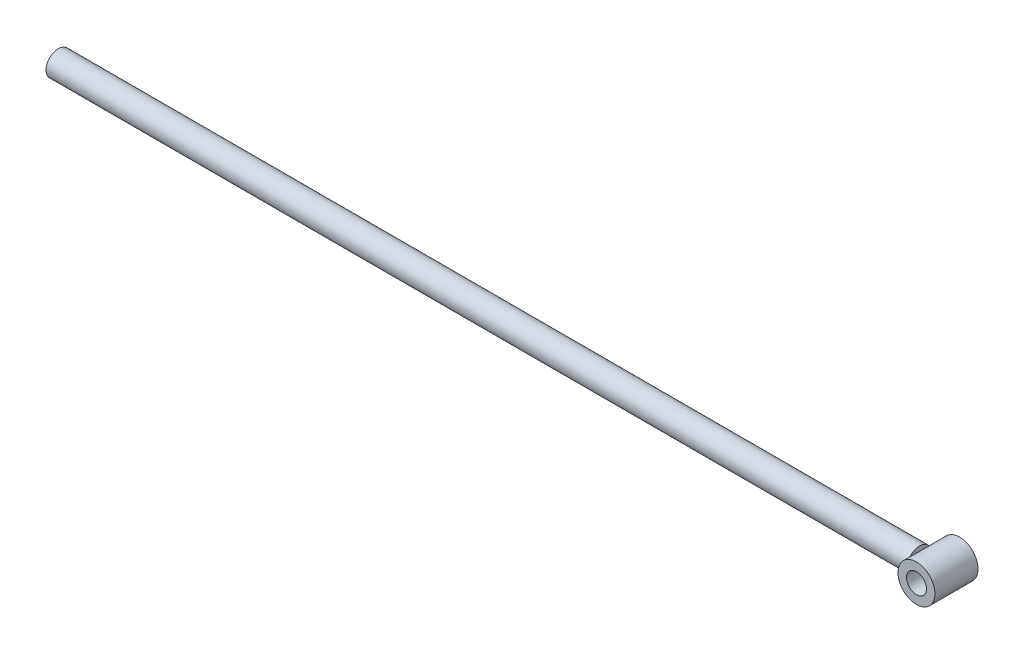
ISO-10303-21;
HEADER;
FILE_DESCRIPTION(('STEP AP214'),'2;1');
FILE_NAME('part.step','',(''),(''),'','','');
FILE_SCHEMA(('AUTOMOTIVE_DESIGN { 1 0 10303 214 1 1 1 1 }'));
ENDSEC;
DATA;
#1=APPLICATION_CONTEXT('core data for automotive mechanical design processes');
#2=APPLICATION_PROTOCOL_DEFINITION('international standard','automotive_design',2000,#1);
#3=PRODUCT_CONTEXT('',#1,'mechanical');
#4=PRODUCT('Part','Part','',(#3));
#5=PRODUCT_RELATED_PRODUCT_CATEGORY('part','',(#4));
#6=PRODUCT_DEFINITION_FORMATION('','',#4);
#7=PRODUCT_DEFINITION_CONTEXT('part definition',#1,'design');
#8=PRODUCT_DEFINITION('design','',#6,#7);
#9=PRODUCT_DEFINITION_SHAPE('','',#8);
#10=(LENGTH_UNIT() NAMED_UNIT(*) SI_UNIT(.MILLI.,.METRE.));
#11=(NAMED_UNIT(*) PLANE_ANGLE_UNIT() SI_UNIT($,.RADIAN.));
#12=(NAMED_UNIT(*) SI_UNIT($,.STERADIAN.) SOLID_ANGLE_UNIT());
#13=UNCERTAINTY_MEASURE_WITH_UNIT(LENGTH_MEASURE(1.E-05),#10,'distance_accuracy_value','');
#14=(GEOMETRIC_REPRESENTATION_CONTEXT(3) GLOBAL_UNCERTAINTY_ASSIGNED_CONTEXT((#13)) GLOBAL_UNIT_ASSIGNED_CONTEXT((#10,
#11,#12)) REPRESENTATION_CONTEXT('',''));
#15=CARTESIAN_POINT('',(0.,0.,0.));
#16=DIRECTION('',(0.,0.,1.));
#17=DIRECTION('',(1.,0.,0.));
#18=AXIS2_PLACEMENT_3D('',#15,#16,#17);
#19=CARTESIAN_POINT('',(715.,0.,17.5));
#20=DIRECTION('',(0.,0.,1.));
#21=DIRECTION('',(1.,0.,0.));
#22=AXIS2_PLACEMENT_3D('',#19,#20,#21);
#23=PLANE('',#22);
#24=CARTESIAN_POINT('',(715.,0.,17.5));
#25=DIRECTION('',(0.,0.,1.));
#26=DIRECTION('',(1.,0.,0.));
#27=AXIS2_PLACEMENT_3D('',#24,#25,#26);
#28=CIRCLE('',#27,15.);
#29=CARTESIAN_POINT('',(730.,0.,17.5));
#30=VERTEX_POINT('',#29);
#31=EDGE_CURVE('E11',#30,#30,#28,.T.);
#32=ORIENTED_EDGE('',*,*,#31,.T.);
#33=EDGE_LOOP('',(#32));
#34=FACE_BOUND('',#33,.T.);
#35=CARTESIAN_POINT('',(715.,0.,17.5));
#36=DIRECTION('',(0.,0.,1.));
#37=DIRECTION('',(1.,0.,0.));
#38=AXIS2_PLACEMENT_3D('',#35,#36,#37);
#39=CIRCLE('',#38,8.10000000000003);
#40=CARTESIAN_POINT('',(723.1,0.,17.5));
#41=VERTEX_POINT('',#40);
#42=EDGE_CURVE('E48',#41,#41,#39,.T.);
#43=ORIENTED_EDGE('',*,*,#42,.F.);
#44=EDGE_LOOP('',(#43));
#45=FACE_BOUND('',#44,.T.);
#46=ADVANCED_FACE('F37',(#34,#45),#23,.T.);
#47=CARTESIAN_POINT('',(715.,0.,-17.5));
#48=DIRECTION('',(0.,0.,1.));
#49=DIRECTION('',(1.,0.,0.));
#50=AXIS2_PLACEMENT_3D('',#47,#48,#49);
#51=PLANE('',#50);
#52=CARTESIAN_POINT('',(715.,0.,-17.5));
#53=DIRECTION('',(0.,0.,1.));
#54=DIRECTION('',(1.,0.,0.));
#55=AXIS2_PLACEMENT_3D('',#52,#53,#54);
#56=CIRCLE('',#55,15.);
#57=CARTESIAN_POINT('',(730.,0.,-17.5));
#58=VERTEX_POINT('',#57);
#59=EDGE_CURVE('E41',#58,#58,#56,.T.);
#60=ORIENTED_EDGE('',*,*,#59,.F.);
#61=EDGE_LOOP('',(#60));
#62=FACE_BOUND('',#61,.T.);
#63=CARTESIAN_POINT('',(715.,0.,-17.5));
#64=DIRECTION('',(0.,0.,1.));
#65=DIRECTION('',(1.,0.,0.));
#66=AXIS2_PLACEMENT_3D('',#63,#64,#65);
#67=CIRCLE('',#66,8.10000000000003);
#68=CARTESIAN_POINT('',(723.1,0.,-17.5));
#69=VERTEX_POINT('',#68);
#70=EDGE_CURVE('E50',#69,#69,#67,.T.);
#71=ORIENTED_EDGE('',*,*,#70,.T.);
#72=EDGE_LOOP('',(#71));
#73=FACE_BOUND('',#72,.T.);
#74=ADVANCED_FACE('F60',(#62,#73),#51,.F.);
#75=CARTESIAN_POINT('',(715.,0.,17.5));
#76=DIRECTION('',(0.,0.,-1.));
#77=DIRECTION('',(-1.,0.,0.));
#78=AXIS2_PLACEMENT_3D('',#75,#76,#77);
#79=CYLINDRICAL_SURFACE('',#78,15.);
#80=ORIENTED_EDGE('',*,*,#31,.F.);
#81=EDGE_LOOP('',(#80));
#82=FACE_BOUND('',#81,.T.);
#83=ORIENTED_EDGE('',*,*,#59,.T.);
#84=EDGE_LOOP('',(#83));
#85=FACE_BOUND('',#84,.T.);
#86=ADVANCED_FACE('F39',(#82,#85),#79,.T.);
#87=CARTESIAN_POINT('',(715.,0.,17.5));
#88=DIRECTION('',(0.,0.,-1.));
#89=DIRECTION('',(-1.,0.,0.));
#90=AXIS2_PLACEMENT_3D('',#87,#88,#89);
#91=CYLINDRICAL_SURFACE('',#90,8.10000000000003);
#92=ORIENTED_EDGE('',*,*,#42,.T.);
#93=EDGE_LOOP('',(#92));
#94=FACE_BOUND('',#93,.T.);
#95=ORIENTED_EDGE('',*,*,#70,.F.);
#96=EDGE_LOOP('',(#95));
#97=FACE_BOUND('',#96,.T.);
#98=ADVANCED_FACE('F56',(#94,#97),#91,.F.);
#99=CLOSED_SHELL('',(#46,#74,#86,#98));
#100=MANIFOLD_SOLID_BREP('B2',#99);
#101=CARTESIAN_POINT('',(700.,0.,0.));
#102=DIRECTION('',(-1.,0.,0.));
#103=DIRECTION('',(0.,0.,1.));
#104=AXIS2_PLACEMENT_3D('',#101,#102,#103);
#105=CYLINDRICAL_SURFACE('',#104,10.);
#106=CARTESIAN_POINT('',(700.,0.,0.));
#107=DIRECTION('',(1.,0.,0.));
#108=DIRECTION('',(0.,0.,-1.));
#109=AXIS2_PLACEMENT_3D('',#106,#107,#108);
#110=CIRCLE('',#109,10.);
#111=CARTESIAN_POINT('',(700.,0.,-10.));
#112=VERTEX_POINT('',#111);
#113=EDGE_CURVE('E36',#112,#112,#110,.T.);
#114=ORIENTED_EDGE('',*,*,#113,.F.);
#115=EDGE_LOOP('',(#114));
#116=FACE_BOUND('',#115,.T.);
#117=CARTESIAN_POINT('',(0.,0.,0.));
#118=DIRECTION('',(1.,0.,0.));
#119=DIRECTION('',(0.,0.,-1.));
#120=AXIS2_PLACEMENT_3D('',#117,#118,#119);
#121=CIRCLE('',#120,10.);
#122=CARTESIAN_POINT('',(0.,0.,-10.));
#123=VERTEX_POINT('',#122);
#124=EDGE_CURVE('E102',#123,#123,#121,.T.);
#125=ORIENTED_EDGE('',*,*,#124,.T.);
#126=EDGE_LOOP('',(#125));
#127=FACE_BOUND('',#126,.T.);
#128=ADVANCED_FACE('F99',(#116,#127),#105,.T.);
#129=CARTESIAN_POINT('',(700.,0.,0.));
#130=DIRECTION('',(1.,0.,0.));
#131=DIRECTION('',(0.,0.,-1.));
#132=AXIS2_PLACEMENT_3D('',#129,#130,#131);
#133=PLANE('',#132);
#134=ORIENTED_EDGE('',*,*,#113,.T.);
#135=EDGE_LOOP('',(#134));
#136=FACE_BOUND('',#135,.T.);
#137=ADVANCED_FACE('F114',(#136),#133,.T.);
#138=CARTESIAN_POINT('',(0.,0.,0.));
#139=DIRECTION('',(1.,0.,0.));
#140=DIRECTION('',(0.,0.,-1.));
#141=AXIS2_PLACEMENT_3D('',#138,#139,#140);
#142=PLANE('',#141);
#143=ORIENTED_EDGE('',*,*,#124,.F.);
#144=EDGE_LOOP('',(#143));
#145=FACE_BOUND('',#144,.T.);
#146=ADVANCED_FACE('F112',(#145),#142,.F.);
#147=CLOSED_SHELL('',(#128,#137,#146));
#148=MANIFOLD_SOLID_BREP('B6',#147);
#149=ADVANCED_BREP_SHAPE_REPRESENTATION('',(#18,#100,#148),#14);
#150=SHAPE_DEFINITION_REPRESENTATION(#9,#149);
ENDSEC;
END-ISO-10303-21;
